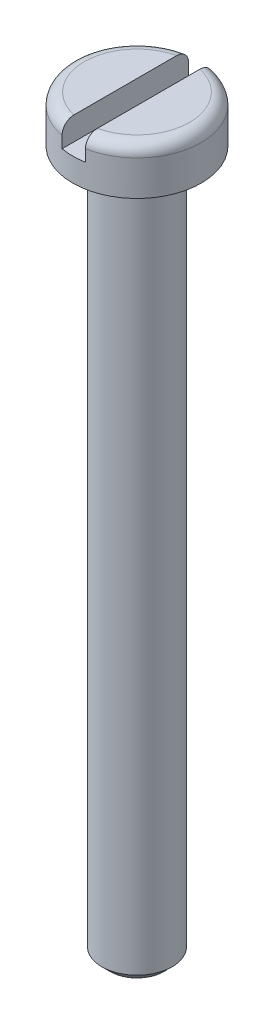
from build123d import *

# Parameters (mm, degrees)
ESQUISSE1_R                  = 1.5
BOSS_EXTRU_1_DEPTH           = 30
CHANFREIN1_SIZE              = 0.35
ESQUISSE2_R                  = 2.75
BOSS_EXTRU_2_DEPTH           = 2
CONG_1_R                     = 0.5
ENL_V_MAT_EXTRU_1_DEPTH      = 33.235461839
ENL_V_MAT_EXTRU_1_DEPTH_BACK = 33.235461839
ESQUISSE4_W                  = 1
ESQUISSE4_H                  = 2


with BuildPart() as part:
    # Esquisse1 → Boss.-Extru.1 (new body)
    with BuildSketch(Plane(origin=(0, 0, 0), x_dir=(1, 0, 0), z_dir=(0, 1, 0))):
        with Locations(Location((0, 0, 0), (0, 0, 270))):
            Circle(ESQUISSE1_R)
    extrude(amount=BOSS_EXTRU_1_DEPTH)

    # Chanfrein1
    chanfrein1_edges = [part.edges().sort_by_distance(p)[0] for p in [
        (0, 0, -1.5),
    ]]
    chamfer(chanfrein1_edges, length=CHANFREIN1_SIZE)

    # Esquisse2 → Boss.-Extru.2 (add)
    with BuildSketch(Plane(origin=(0, 30, 0), x_dir=(1, 0, 0), z_dir=(0, 1, 0))):
        with Locations(Location((0, 0, 0), (0, 0, 270))):
            Circle(ESQUISSE2_R)
    extrude(amount=BOSS_EXTRU_2_DEPTH)

    # Cong_1
    cong_1_edges = [part.edges().sort_by_distance(p)[0] for p in [
        (0, 32, -2.75),
    ]]
    fillet(cong_1_edges, radius=CONG_1_R)

    # Esquisse4 → Enl_v. mat.-Extru.1 (cut, two sides: drawn at the far end of the back side and taken through both)
    with BuildSketch(Plane.XY.offset(-ENL_V_MAT_EXTRU_1_DEPTH_BACK)):
        with Locations((0, 32)):
            Rectangle(ESQUISSE4_W, ESQUISSE4_H)
    extrude(amount=ENL_V_MAT_EXTRU_1_DEPTH + ENL_V_MAT_EXTRU_1_DEPTH_BACK, mode=Mode.SUBTRACT)


solid = part.part
